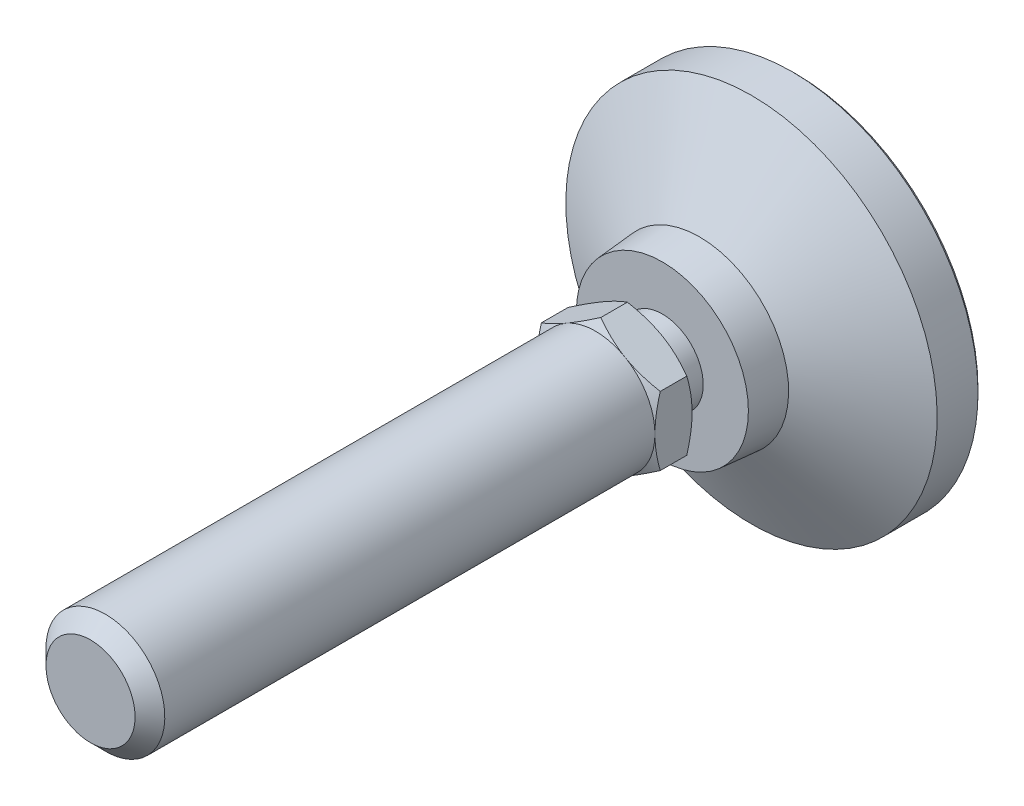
ISO-10303-21;
HEADER;
FILE_DESCRIPTION(('STEP AP214'),'2;1');
FILE_NAME('part.step','',(''),(''),'','','');
FILE_SCHEMA(('AUTOMOTIVE_DESIGN { 1 0 10303 214 1 1 1 1 }'));
ENDSEC;
DATA;
#1=APPLICATION_CONTEXT('core data for automotive mechanical design processes');
#2=APPLICATION_PROTOCOL_DEFINITION('international standard','automotive_design',2000,#1);
#3=PRODUCT_CONTEXT('',#1,'mechanical');
#4=PRODUCT('Part','Part','',(#3));
#5=PRODUCT_RELATED_PRODUCT_CATEGORY('part','',(#4));
#6=PRODUCT_DEFINITION_FORMATION('','',#4);
#7=PRODUCT_DEFINITION_CONTEXT('part definition',#1,'design');
#8=PRODUCT_DEFINITION('design','',#6,#7);
#9=PRODUCT_DEFINITION_SHAPE('','',#8);
#10=(LENGTH_UNIT() NAMED_UNIT(*) SI_UNIT(.MILLI.,.METRE.));
#11=(NAMED_UNIT(*) PLANE_ANGLE_UNIT() SI_UNIT($,.RADIAN.));
#12=(NAMED_UNIT(*) SI_UNIT($,.STERADIAN.) SOLID_ANGLE_UNIT());
#13=UNCERTAINTY_MEASURE_WITH_UNIT(LENGTH_MEASURE(1.E-05),#10,'distance_accuracy_value','');
#14=(GEOMETRIC_REPRESENTATION_CONTEXT(3) GLOBAL_UNCERTAINTY_ASSIGNED_CONTEXT((#13)) GLOBAL_UNIT_ASSIGNED_CONTEXT((#10,
#11,#12)) REPRESENTATION_CONTEXT('',''));
#15=CARTESIAN_POINT('',(0.,0.,0.));
#16=DIRECTION('',(0.,0.,1.));
#17=DIRECTION('',(1.,0.,0.));
#18=AXIS2_PLACEMENT_3D('',#15,#16,#17);
#19=CARTESIAN_POINT('',(0.,-5.50000000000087,21.9999999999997));
#20=DIRECTION('',(0.,0.,-1.));
#21=DIRECTION('',(0.,1.,0.));
#22=AXIS2_PLACEMENT_3D('',#19,#20,#21);
#23=PLANE('',#22);
#24=CARTESIAN_POINT('',(0.,0.,21.9999999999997));
#25=DIRECTION('',(0.,0.,-1.));
#26=DIRECTION('',(0.,1.,0.));
#27=AXIS2_PLACEMENT_3D('',#24,#25,#26);
#28=CIRCLE('',#27,8.00000000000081);
#29=CARTESIAN_POINT('',(-4.00000000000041,6.92820323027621,21.9999999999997));
#30=VERTEX_POINT('',#29);
#31=CARTESIAN_POINT('',(-8.00000000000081,0.,21.9999999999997));
#32=VERTEX_POINT('',#31);
#33=EDGE_CURVE('E9',#30,#32,#28,.F.);
#34=ORIENTED_EDGE('',*,*,#33,.F.);
#35=CARTESIAN_POINT('',(4.,6.92820323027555,21.9999999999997));
#36=VERTEX_POINT('',#35);
#37=EDGE_CURVE('E18',#36,#30,#28,.F.);
#38=ORIENTED_EDGE('',*,*,#37,.F.);
#39=CARTESIAN_POINT('',(8.00000000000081,0.,21.9999999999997));
#40=VERTEX_POINT('',#39);
#41=EDGE_CURVE('E125',#40,#36,#28,.F.);
#42=ORIENTED_EDGE('',*,*,#41,.F.);
#43=CARTESIAN_POINT('',(0.,0.,21.9999999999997));
#44=DIRECTION('',(0.,0.,1.));
#45=DIRECTION('',(0.,-1.,0.));
#46=AXIS2_PLACEMENT_3D('',#43,#44,#45);
#47=CIRCLE('',#46,8.00000000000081);
#48=CARTESIAN_POINT('',(4.00000000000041,-6.92820323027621,21.9999999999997));
#49=VERTEX_POINT('',#48);
#50=EDGE_CURVE('E599',#49,#40,#47,.T.);
#51=ORIENTED_EDGE('',*,*,#50,.F.);
#52=CARTESIAN_POINT('',(-4.00000000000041,-6.92820323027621,21.9999999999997));
#53=VERTEX_POINT('',#52);
#54=EDGE_CURVE('E601',#53,#49,#28,.F.);
#55=ORIENTED_EDGE('',*,*,#54,.F.);
#56=EDGE_CURVE('E23',#32,#53,#28,.F.);
#57=ORIENTED_EDGE('',*,*,#56,.F.);
#58=EDGE_LOOP('',(#34,#38,#42,#51,#55,#57));
#59=FACE_BOUND('',#58,.T.);
#60=CARTESIAN_POINT('',(0.,0.,21.9999999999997));
#61=DIRECTION('',(0.,0.,-1.));
#62=DIRECTION('',(0.,1.,0.));
#63=AXIS2_PLACEMENT_3D('',#60,#61,#62);
#64=CIRCLE('',#63,5.50000000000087);
#65=CARTESIAN_POINT('',(0.,5.50000000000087,21.9999999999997));
#66=VERTEX_POINT('',#65);
#67=EDGE_CURVE('E226',#66,#66,#64,.T.);
#68=ORIENTED_EDGE('',*,*,#67,.F.);
#69=EDGE_LOOP('',(#68));
#70=FACE_BOUND('',#69,.T.);
#71=ADVANCED_FACE('F14',(#59,#70),#23,.T.);
#72=CARTESIAN_POINT('',(0.,0.,-1.));
#73=DIRECTION('',(0.,0.,-1.));
#74=DIRECTION('',(0.,1.,0.));
#75=AXIS2_PLACEMENT_3D('',#72,#73,#74);
#76=CYLINDRICAL_SURFACE('',#75,5.50000000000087);
#77=CARTESIAN_POINT('',(0.,0.,18.));
#78=DIRECTION('',(0.,0.,-1.));
#79=DIRECTION('',(0.,1.,0.));
#80=AXIS2_PLACEMENT_3D('',#77,#78,#79);
#81=CIRCLE('',#80,5.50000000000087);
#82=CARTESIAN_POINT('',(0.,5.50000000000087,18.));
#83=VERTEX_POINT('',#82);
#84=EDGE_CURVE('E229',#83,#83,#81,.T.);
#85=ORIENTED_EDGE('',*,*,#84,.F.);
#86=EDGE_LOOP('',(#85));
#87=FACE_BOUND('',#86,.T.);
#88=ORIENTED_EDGE('',*,*,#67,.T.);
#89=EDGE_LOOP('',(#88));
#90=FACE_BOUND('',#89,.T.);
#91=ADVANCED_FACE('F289',(#87,#90),#76,.T.);
#92=CARTESIAN_POINT('',(0.,-5.50000000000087,18.));
#93=DIRECTION('',(0.,0.,1.));
#94=DIRECTION('',(0.,-1.,0.));
#95=AXIS2_PLACEMENT_3D('',#92,#93,#94);
#96=PLANE('',#95);
#97=ORIENTED_EDGE('',*,*,#84,.T.);
#98=EDGE_LOOP('',(#97));
#99=FACE_BOUND('',#98,.T.);
#100=CARTESIAN_POINT('',(0.,0.,18.));
#101=DIRECTION('',(0.,0.,1.));
#102=DIRECTION('',(0.,-1.,0.));
#103=AXIS2_PLACEMENT_3D('',#100,#101,#102);
#104=CIRCLE('',#103,11.5833333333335);
#105=CARTESIAN_POINT('',(0.,-11.5833333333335,18.));
#106=VERTEX_POINT('',#105);
#107=EDGE_CURVE('E232',#106,#106,#104,.T.);
#108=ORIENTED_EDGE('',*,*,#107,.T.);
#109=EDGE_LOOP('',(#108));
#110=FACE_BOUND('',#109,.T.);
#111=ADVANCED_FACE('F281',(#99,#110),#96,.T.);
#112=CARTESIAN_POINT('',(0.,0.,0.));
#113=DIRECTION('',(0.,0.,-1.));
#114=DIRECTION('',(0.,1.,0.));
#115=AXIS2_PLACEMENT_3D('',#112,#113,#114);
#116=PLANE('',#115);
#117=CARTESIAN_POINT('',(0.,0.,0.));
#118=DIRECTION('',(0.,0.,-1.));
#119=DIRECTION('',(0.,1.,0.));
#120=AXIS2_PLACEMENT_3D('',#117,#118,#119);
#121=CIRCLE('',#120,24.5);
#122=CARTESIAN_POINT('',(0.,24.5,0.));
#123=VERTEX_POINT('',#122);
#124=EDGE_CURVE('E267',#123,#123,#121,.T.);
#125=ORIENTED_EDGE('',*,*,#124,.T.);
#126=EDGE_LOOP('',(#125));
#127=FACE_BOUND('',#126,.T.);
#128=ADVANCED_FACE('F199',(#127),#116,.T.);
#129=CARTESIAN_POINT('',(0.,0.,-1.));
#130=DIRECTION('',(0.,0.,-1.));
#131=DIRECTION('',(0.,1.,0.));
#132=AXIS2_PLACEMENT_3D('',#129,#130,#131);
#133=CYLINDRICAL_SURFACE('',#132,25.);
#134=CARTESIAN_POINT('',(0.,0.,0.500000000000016));
#135=DIRECTION('',(0.,0.,-1.));
#136=DIRECTION('',(0.,1.,0.));
#137=AXIS2_PLACEMENT_3D('',#134,#135,#136);
#138=CIRCLE('',#137,25.);
#139=CARTESIAN_POINT('',(0.,25.,0.500000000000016));
#140=VERTEX_POINT('',#139);
#141=EDGE_CURVE('E126',#140,#140,#138,.F.);
#142=ORIENTED_EDGE('',*,*,#141,.T.);
#143=EDGE_LOOP('',(#142));
#144=FACE_BOUND('',#143,.T.);
#145=CARTESIAN_POINT('',(0.,0.,5.9999999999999));
#146=DIRECTION('',(0.,0.,-1.));
#147=DIRECTION('',(0.,1.,0.));
#148=AXIS2_PLACEMENT_3D('',#145,#146,#147);
#149=CIRCLE('',#148,25.);
#150=CARTESIAN_POINT('',(0.,25.,5.9999999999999));
#151=VERTEX_POINT('',#150);
#152=EDGE_CURVE('E235',#151,#151,#149,.T.);
#153=ORIENTED_EDGE('',*,*,#152,.T.);
#154=EDGE_LOOP('',(#153));
#155=FACE_BOUND('',#154,.T.);
#156=ADVANCED_FACE('F272',(#144,#155),#133,.T.);
#157=CARTESIAN_POINT('',(0.,0.,13.));
#158=DIRECTION('',(0.,0.,-1.));
#159=DIRECTION('',(0.,1.,0.));
#160=AXIS2_PLACEMENT_3D('',#157,#158,#159);
#161=CONICAL_SURFACE('',#160,12.0000000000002,1.07685495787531);
#162=ORIENTED_EDGE('',*,*,#152,.F.);
#163=EDGE_LOOP('',(#162));
#164=FACE_BOUND('',#163,.T.);
#165=CARTESIAN_POINT('',(0.,0.,13.));
#166=DIRECTION('',(0.,0.,-1.));
#167=DIRECTION('',(0.,1.,0.));
#168=AXIS2_PLACEMENT_3D('',#165,#166,#167);
#169=CIRCLE('',#168,12.0000000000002);
#170=CARTESIAN_POINT('',(0.,12.0000000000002,13.));
#171=VERTEX_POINT('',#170);
#172=EDGE_CURVE('E251',#171,#171,#169,.T.);
#173=ORIENTED_EDGE('',*,*,#172,.T.);
#174=EDGE_LOOP('',(#173));
#175=FACE_BOUND('',#174,.T.);
#176=ADVANCED_FACE('F288',(#164,#175),#161,.T.);
#177=CARTESIAN_POINT('',(0.,0.,19.));
#178=DIRECTION('',(0.,0.,-1.));
#179=DIRECTION('',(0.,1.,0.));
#180=AXIS2_PLACEMENT_3D('',#177,#178,#179);
#181=CONICAL_SURFACE('',#180,11.5000000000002,0.0831412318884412);
#182=ORIENTED_EDGE('',*,*,#172,.F.);
#183=EDGE_LOOP('',(#182));
#184=FACE_BOUND('',#183,.T.);
#185=ORIENTED_EDGE('',*,*,#107,.F.);
#186=EDGE_LOOP('',(#185));
#187=FACE_BOUND('',#186,.T.);
#188=ADVANCED_FACE('F277',(#184,#187),#181,.T.);
#189=CARTESIAN_POINT('',(0.,0.,0.));
#190=DIRECTION('',(0.,0.,1.));
#191=DIRECTION('',(0.,-1.,0.));
#192=AXIS2_PLACEMENT_3D('',#189,#190,#191);
#193=CONICAL_SURFACE('',#192,24.5,0.785398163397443);
#194=ORIENTED_EDGE('',*,*,#141,.F.);
#195=EDGE_LOOP('',(#194));
#196=FACE_BOUND('',#195,.T.);
#197=ORIENTED_EDGE('',*,*,#124,.F.);
#198=EDGE_LOOP('',(#197));
#199=FACE_BOUND('',#198,.T.);
#200=ADVANCED_FACE('F16',(#196,#199),#193,.T.);
#201=CARTESIAN_POINT('',(0.,0.,21.9999999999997));
#202=DIRECTION('',(0.,0.,1.));
#203=DIRECTION('',(0.,-1.,0.));
#204=AXIS2_PLACEMENT_3D('',#201,#202,#203);
#205=CONICAL_SURFACE('',#204,8.00000000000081,1.0471975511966);
#206=CARTESIAN_POINT('',(-8.0002,4.61868668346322,22.7145978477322));
#207=CARTESIAN_POINT('',(-7.8243512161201,4.72021302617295,22.6559907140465));
#208=CARTESIAN_POINT('',(-7.64784680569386,4.8221178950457,22.6000434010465));
#209=CARTESIAN_POINT('',(-7.29340453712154,5.02675523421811,22.4942010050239));
#210=CARTESIAN_POINT('',(-7.11546609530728,5.12948804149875,22.4443085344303));
#211=CARTESIAN_POINT('',(-6.57880176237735,5.43933133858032,22.3046927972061));
#212=CARTESIAN_POINT('',(-6.21795741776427,5.64766491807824,22.2252811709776));
#213=CARTESIAN_POINT('',(-5.67796082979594,5.95943209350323,22.1321616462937));
#214=CARTESIAN_POINT('',(-5.50042181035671,6.06193429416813,22.1056345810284));
#215=CARTESIAN_POINT('',(-5.14454088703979,6.26740224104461,22.0611531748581));
#216=CARTESIAN_POINT('',(-4.96619905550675,6.37036794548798,22.0431980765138));
#217=CARTESIAN_POINT('',(-4.6092083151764,6.57647664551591,22.0163156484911));
#218=CARTESIAN_POINT('',(-4.43055998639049,6.67961930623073,22.0073780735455));
#219=CARTESIAN_POINT('',(-4.07309829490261,6.88599991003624,21.9987223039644));
#220=CARTESIAN_POINT('',(-3.89428493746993,6.9892378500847,21.9990038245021));
#221=CARTESIAN_POINT('',(-3.55998663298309,7.18224506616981,22.008145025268));
#222=CARTESIAN_POINT('',(-3.40447809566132,7.27202796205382,22.0158896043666));
#223=CARTESIAN_POINT('',(-3.09382523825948,7.45138347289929,22.0382011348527));
#224=CARTESIAN_POINT('',(-2.93868094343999,7.54095607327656,22.0527685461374));
#225=CARTESIAN_POINT('',(-2.47384868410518,7.80932710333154,22.1063606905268));
#226=CARTESIAN_POINT('',(-2.16498351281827,7.98765049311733,22.1552686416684));
#227=CARTESIAN_POINT('',(-1.54397677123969,8.3461889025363,22.2775394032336));
#228=CARTESIAN_POINT('',(-1.23191445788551,8.52635816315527,22.3514205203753));
#229=CARTESIAN_POINT('',(-0.61244351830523,8.8840098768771,22.5191001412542));
#230=CARTESIAN_POINT('',(-0.305026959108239,9.06149691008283,22.6128592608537));
#231=CARTESIAN_POINT('',(0.000200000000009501,9.23771977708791,22.7145978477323));
#232=B_SPLINE_CURVE_WITH_KNOTS('',3,(#206,#207,#208,#209,#210,#211,#212,#213,#214,#215,#216,
#217,#218,#219,#220,#221,#222,#223,#224,#225,#226,#227,#228,#229,#230,#231),.UNSPECIFIED.,.F.,
.F.,(4,2,2,2,2,2,2,2,2,2,2,2,4),(0.,0.633973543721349,1.26821965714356,2.53934712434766,
3.15934343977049,3.77928496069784,4.39852133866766,5.01773858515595,5.55680239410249,
6.09590254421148,7.17487077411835,8.27776850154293,9.37850115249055),.UNSPECIFIED.);
#233=CARTESIAN_POINT('',(0.,9.23760430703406,22.7145311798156));
#234=VERTEX_POINT('',#233);
#235=EDGE_CURVE('E115',#30,#234,#232,.T.);
#236=ORIENTED_EDGE('',*,*,#235,.T.);
#237=CARTESIAN_POINT('',(-0.000199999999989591,9.2377197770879,22.7145978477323));
#238=CARTESIAN_POINT('',(0.175648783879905,9.13619343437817,22.6559907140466));
#239=CARTESIAN_POINT('',(0.352153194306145,9.03428856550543,22.6000434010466));
#240=CARTESIAN_POINT('',(0.706595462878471,8.82965122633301,22.4942010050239));
#241=CARTESIAN_POINT('',(0.884533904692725,8.72691841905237,22.4443085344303));
#242=CARTESIAN_POINT('',(1.42119823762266,8.4170751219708,22.3046927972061));
#243=CARTESIAN_POINT('',(1.78204258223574,8.20874154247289,22.2252811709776));
#244=CARTESIAN_POINT('',(2.32203917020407,7.89697436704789,22.1321616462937));
#245=CARTESIAN_POINT('',(2.49957818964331,7.79447216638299,22.1056345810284));
#246=CARTESIAN_POINT('',(2.85545911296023,7.58900421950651,22.0611531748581));
#247=CARTESIAN_POINT('',(3.03380094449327,7.48603851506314,22.0431980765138));
#248=CARTESIAN_POINT('',(3.39079168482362,7.2799298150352,22.0163156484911));
#249=CARTESIAN_POINT('',(3.56944001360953,7.17678715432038,22.0073780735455));
#250=CARTESIAN_POINT('',(3.92690170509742,6.97040655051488,21.9987223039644));
#251=CARTESIAN_POINT('',(4.1057150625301,6.86716861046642,21.9990038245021));
#252=CARTESIAN_POINT('',(4.44001336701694,6.67416139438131,22.008145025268));
#253=CARTESIAN_POINT('',(4.5955219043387,6.5843784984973,22.0158896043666));
#254=CARTESIAN_POINT('',(4.90617476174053,6.40502298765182,22.0382011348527));
#255=CARTESIAN_POINT('',(5.06131905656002,6.31545038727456,22.0527685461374));
#256=CARTESIAN_POINT('',(5.52615131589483,6.04707935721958,22.1063606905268));
#257=CARTESIAN_POINT('',(5.83501648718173,5.86875596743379,22.1552686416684));
#258=CARTESIAN_POINT('',(6.45602322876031,5.51021755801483,22.2775394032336));
#259=CARTESIAN_POINT('',(6.76808554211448,5.33004829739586,22.3514205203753));
#260=CARTESIAN_POINT('',(7.38755648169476,4.97239658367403,22.5191001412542));
#261=CARTESIAN_POINT('',(7.69497304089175,4.79490955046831,22.6128592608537));
#262=CARTESIAN_POINT('',(8.0002,4.61868668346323,22.7145978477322));
#263=B_SPLINE_CURVE_WITH_KNOTS('',3,(#237,#238,#239,#240,#241,#242,#243,#244,#245,#246,#247,
#248,#249,#250,#251,#252,#253,#254,#255,#256,#257,#258,#259,#260,#261,#262),.UNSPECIFIED.,.F.,
.F.,(4,2,2,2,2,2,2,2,2,2,2,2,4),(0.,0.633973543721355,1.26821965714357,2.53934712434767,
3.15934343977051,3.77928496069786,4.39852133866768,5.01773858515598,5.55680239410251,
6.09590254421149,7.17487077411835,8.27776850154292,9.37850115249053),.UNSPECIFIED.);
#264=EDGE_CURVE('E121',#234,#36,#263,.T.);
#265=ORIENTED_EDGE('',*,*,#264,.T.);
#266=ORIENTED_EDGE('',*,*,#37,.T.);
#267=EDGE_LOOP('',(#236,#265,#266));
#268=FACE_BOUND('',#267,.T.);
#269=ADVANCED_FACE('F119',(#268),#205,.T.);
#270=CARTESIAN_POINT('',(8.,12.3485370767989,25.876027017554));
#271=CARTESIAN_POINT('',(8.,11.9996128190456,25.7070020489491));
#272=CARTESIAN_POINT('',(8.,11.6498813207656,25.5396146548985));
#273=CARTESIAN_POINT('',(8.,10.9483743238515,25.2090371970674));
#274=CARTESIAN_POINT('',(8.,10.5965985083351,25.0458478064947));
#275=CARTESIAN_POINT('',(8.,9.88873279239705,24.7237550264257));
#276=CARTESIAN_POINT('',(8.,9.53262979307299,24.5648803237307));
#277=CARTESIAN_POINT('',(8.,8.81757115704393,24.2537106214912));
#278=CARTESIAN_POINT('',(8.,8.45861565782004,24.1014153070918));
#279=CARTESIAN_POINT('',(8.,7.7259103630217,23.8004732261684));
#280=CARTESIAN_POINT('',(8.,7.35205069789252,23.6520924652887));
#281=CARTESIAN_POINT('',(8.,6.59993691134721,23.3667023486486));
#282=CARTESIAN_POINT('',(8.,6.22168229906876,23.229694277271));
#283=CARTESIAN_POINT('',(8.,5.46089929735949,22.9706894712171));
#284=CARTESIAN_POINT('',(8.,5.07838154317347,22.8486618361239));
#285=CARTESIAN_POINT('',(8.,4.30787342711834,22.6235701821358));
#286=CARTESIAN_POINT('',(8.,3.91988484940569,22.5205001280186));
#287=CARTESIAN_POINT('',(8.,3.14029784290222,22.3388616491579));
#288=CARTESIAN_POINT('',(8.,2.74873078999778,22.2601622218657));
#289=CARTESIAN_POINT('',(8.,2.157861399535,22.1638258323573));
#290=CARTESIAN_POINT('',(8.,1.96030347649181,22.1353311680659));
#291=CARTESIAN_POINT('',(8.,1.56422556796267,22.0861396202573));
#292=CARTESIAN_POINT('',(8.,1.36570567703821,22.0654419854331));
#293=CARTESIAN_POINT('',(8.,0.970537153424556,22.0325133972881));
#294=CARTESIAN_POINT('',(8.,0.773897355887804,22.0201768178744));
#295=CARTESIAN_POINT('',(8.,0.380272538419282,22.0038261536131));
#296=CARTESIAN_POINT('',(8.,0.183287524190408,21.9998119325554));
#297=CARTESIAN_POINT('',(8.,-0.210676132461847,22.0002016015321));
#298=CARTESIAN_POINT('',(8.,-0.407654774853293,22.0046055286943));
#299=CARTESIAN_POINT('',(8.,-0.80125313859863,22.0217248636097));
#300=CARTESIAN_POINT('',(8.,-0.997872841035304,22.0344406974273));
#301=CARTESIAN_POINT('',(8.,-1.47219850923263,22.0748753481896));
#302=CARTESIAN_POINT('',(8.,-1.74956690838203,22.1066371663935));
#303=CARTESIAN_POINT('',(8.,-2.30219351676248,22.184955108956));
#304=CARTESIAN_POINT('',(8.,-2.57745142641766,22.2315132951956));
#305=CARTESIAN_POINT('',(8.,-3.39977454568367,22.3909091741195));
#306=CARTESIAN_POINT('',(8.,-3.9430706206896,22.523437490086));
#307=CARTESIAN_POINT('',(8.,-4.75534297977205,22.7525978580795));
#308=CARTESIAN_POINT('',(8.,-5.02854925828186,22.8350932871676));
#309=CARTESIAN_POINT('',(8.,-5.57230728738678,23.008490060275));
#310=CARTESIAN_POINT('',(8.,-5.84285902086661,23.0993914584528));
#311=CARTESIAN_POINT('',(8.,-6.38139598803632,23.2881552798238));
#312=CARTESIAN_POINT('',(8.,-6.64938207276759,23.386015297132));
#313=CARTESIAN_POINT('',(8.,-7.18314516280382,23.5875611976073));
#314=CARTESIAN_POINT('',(8.,-7.44892219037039,23.6912470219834));
#315=CARTESIAN_POINT('',(8.,-8.06083609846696,23.9364645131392));
#316=CARTESIAN_POINT('',(8.,-8.40627199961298,24.0797418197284));
#317=CARTESIAN_POINT('',(8.,-9.09432556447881,24.3729291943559));
#318=CARTESIAN_POINT('',(8.,-9.43694307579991,24.5228396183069));
#319=CARTESIAN_POINT('',(8.,-10.1198578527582,24.8280042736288));
#320=CARTESIAN_POINT('',(8.,-10.4601546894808,24.9832594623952));
#321=CARTESIAN_POINT('',(8.,-11.1387525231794,25.2980794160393));
#322=CARTESIAN_POINT('',(8.,-11.4770534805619,25.4576442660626));
#323=CARTESIAN_POINT('',(8.,-12.1523013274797,25.7804548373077));
#324=CARTESIAN_POINT('',(8.,-12.4892465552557,25.943704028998));
#325=CARTESIAN_POINT('',(8.,-13.1617078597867,26.2731224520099));
#326=CARTESIAN_POINT('',(8.,-13.4972239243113,26.4392917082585));
#327=CARTESIAN_POINT('',(8.,-14.5018793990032,26.9413849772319));
#328=CARTESIAN_POINT('',(8.,-15.1692072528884,27.2809335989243));
#329=CARTESIAN_POINT('',(8.,-16.4469874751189,27.9394117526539));
#330=CARTESIAN_POINT('',(8.,-17.0577129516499,28.2578136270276));
#331=CARTESIAN_POINT('',(8.,-18.27687034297,28.8990216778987));
#332=CARTESIAN_POINT('',(8.,-18.8853021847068,29.22182799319));
#333=CARTESIAN_POINT('',(8.,-20.0989540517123,29.8700575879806));
#334=CARTESIAN_POINT('',(8.,-20.7041782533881,30.195473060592));
#335=CARTESIAN_POINT('',(8.,-21.9131505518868,30.848961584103));
#336=CARTESIAN_POINT('',(8.,-22.5168987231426,31.1770344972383));
#337=CARTESIAN_POINT('',(8.,-23.1200991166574,31.5061047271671));
#338=B_SPLINE_CURVE_WITH_KNOTS('',3,(#270,#271,#272,#273,#274,#275,#276,#277,#278,#279,#280,
#281,#282,#283,#284,#285,#286,#287,#288,#289,#290,#291,#292,#293,#294,#295,#296,#297,#298,#299,
#300,#301,#302,#303,#304,#305,#306,#307,#308,#309,#310,#311,#312,#313,#314,#315,#316,#317,#318,
#319,#320,#321,#322,#323,#324,#325,#326,#327,#328,#329,#330,#331,#332,#333,#334,#335,#336,#337),
.UNSPECIFIED.,.F.,.F.,(4,2,2,2,2,2,2,2,2,2,2,2,2,2,2,2,2,2,2,2,2,2,2,2,2,2,2,2,2,2,2,2,2,4),(0.,
1.16313881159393,2.32646300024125,3.49621936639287,4.66591969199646,5.87246216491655,
7.07914071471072,8.28328684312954,9.48704896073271,10.6842232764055,11.2829004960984,
11.881520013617,12.4724286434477,13.0633276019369,13.6542291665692,14.245161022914,
15.0822298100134,15.9194152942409,17.5947419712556,18.4508411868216,19.3069459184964,
20.1627560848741,21.0185576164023,22.1403791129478,23.2622608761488,24.3843446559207,
25.5064506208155,26.6296617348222,27.7528824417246,29.9990536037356,32.0652599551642,
34.131531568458,36.193010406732,38.2543830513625),.UNSPECIFIED.);
#339=CARTESIAN_POINT('',(8.,4.61880215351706,22.7145311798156));
#340=VERTEX_POINT('',#339);
#341=EDGE_CURVE('E134',#340,#40,#338,.T.);
#342=ORIENTED_EDGE('',*,*,#341,.T.);
#343=ORIENTED_EDGE('',*,*,#41,.T.);
#344=EDGE_CURVE('E171',#36,#340,#263,.T.);
#345=ORIENTED_EDGE('',*,*,#344,.T.);
#346=EDGE_LOOP('',(#342,#343,#345));
#347=FACE_BOUND('',#346,.T.);
#348=ADVANCED_FACE('F159',(#347),#205,.T.);
#349=CARTESIAN_POINT('',(8.0002,-4.61868668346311,22.7145978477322));
#350=CARTESIAN_POINT('',(7.82435121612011,-4.72021302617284,22.6559907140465));
#351=CARTESIAN_POINT('',(7.64784680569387,-4.82211789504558,22.6000434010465));
#352=CARTESIAN_POINT('',(7.29340453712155,-5.02675523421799,22.4942010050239));
#353=CARTESIAN_POINT('',(7.11546609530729,-5.12948804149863,22.4443085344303));
#354=CARTESIAN_POINT('',(6.57880176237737,-5.4393313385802,22.3046927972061));
#355=CARTESIAN_POINT('',(6.21795741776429,-5.64766491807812,22.2252811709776));
#356=CARTESIAN_POINT('',(5.67796082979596,-5.95943209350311,22.1321616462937));
#357=CARTESIAN_POINT('',(5.50042181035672,-6.06193429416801,22.1056345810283));
#358=CARTESIAN_POINT('',(5.14454088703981,-6.26740224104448,22.0611531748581));
#359=CARTESIAN_POINT('',(4.96619905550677,-6.37036794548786,22.0431980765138));
#360=CARTESIAN_POINT('',(4.60920831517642,-6.57647664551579,22.0163156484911));
#361=CARTESIAN_POINT('',(4.43055998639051,-6.67961930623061,22.0073780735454));
#362=CARTESIAN_POINT('',(4.07309829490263,-6.88599991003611,21.9987223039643));
#363=CARTESIAN_POINT('',(3.89428493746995,-6.98923785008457,21.999003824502));
#364=CARTESIAN_POINT('',(3.55998663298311,-7.18224506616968,22.008145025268));
#365=CARTESIAN_POINT('',(3.40447809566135,-7.27202796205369,22.0158896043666));
#366=CARTESIAN_POINT('',(3.09382523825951,-7.45138347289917,22.0382011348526));
#367=CARTESIAN_POINT('',(2.93868094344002,-7.54095607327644,22.0527685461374));
#368=CARTESIAN_POINT('',(2.4738486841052,-7.80932710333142,22.1063606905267));
#369=CARTESIAN_POINT('',(2.16498351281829,-7.98765049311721,22.1552686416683));
#370=CARTESIAN_POINT('',(1.54397677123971,-8.34618890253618,22.2775394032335));
#371=CARTESIAN_POINT('',(1.23191445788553,-8.52635816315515,22.3514205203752));
#372=CARTESIAN_POINT('',(0.61244351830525,-8.88400987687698,22.5191001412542));
#373=CARTESIAN_POINT('',(0.305026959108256,-9.06149691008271,22.6128592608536));
#374=CARTESIAN_POINT('',(-0.000199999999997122,-9.23771977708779,22.7145978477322));
#375=B_SPLINE_CURVE_WITH_KNOTS('',3,(#349,#350,#351,#352,#353,#354,#355,#356,#357,#358,#359,
#360,#361,#362,#363,#364,#365,#366,#367,#368,#369,#370,#371,#372,#373,#374),.UNSPECIFIED.,.F.,
.F.,(4,2,2,2,2,2,2,2,2,2,2,2,4),(0.,0.63397354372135,1.26821965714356,2.53934712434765,
3.15934343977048,3.77928496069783,4.39852133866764,5.01773858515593,5.55680239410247,
6.09590254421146,7.17487077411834,8.27776850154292,9.37850115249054),.UNSPECIFIED.);
#376=CARTESIAN_POINT('',(8.,-4.61880215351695,22.7145311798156));
#377=VERTEX_POINT('',#376);
#378=EDGE_CURVE('E149',#377,#49,#375,.T.);
#379=ORIENTED_EDGE('',*,*,#378,.T.);
#380=ORIENTED_EDGE('',*,*,#50,.T.);
#381=EDGE_CURVE('E114',#40,#377,#338,.T.);
#382=ORIENTED_EDGE('',*,*,#381,.T.);
#383=EDGE_LOOP('',(#379,#380,#382));
#384=FACE_BOUND('',#383,.T.);
#385=ADVANCED_FACE('F163',(#384),#205,.T.);
#386=CARTESIAN_POINT('',(0.000200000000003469,-9.23771977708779,22.7145978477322));
#387=CARTESIAN_POINT('',(-0.175648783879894,-9.13619343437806,22.6559907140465));
#388=CARTESIAN_POINT('',(-0.352153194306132,-9.03428856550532,22.6000434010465));
#389=CARTESIAN_POINT('',(-0.706595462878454,-8.8296512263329,22.4942010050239));
#390=CARTESIAN_POINT('',(-0.884533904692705,-8.72691841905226,22.4443085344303));
#391=CARTESIAN_POINT('',(-1.42119823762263,-8.4170751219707,22.3046927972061));
#392=CARTESIAN_POINT('',(-1.78204258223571,-8.20874154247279,22.2252811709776));
#393=CARTESIAN_POINT('',(-2.32203917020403,-7.8969743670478,22.1321616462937));
#394=CARTESIAN_POINT('',(-2.49957818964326,-7.79447216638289,22.1056345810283));
#395=CARTESIAN_POINT('',(-2.85545911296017,-7.58900421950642,22.0611531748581));
#396=CARTESIAN_POINT('',(-3.03380094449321,-7.48603851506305,22.0431980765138));
#397=CARTESIAN_POINT('',(-3.39079168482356,-7.27992981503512,22.0163156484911));
#398=CARTESIAN_POINT('',(-3.56944001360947,-7.1767871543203,22.0073780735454));
#399=CARTESIAN_POINT('',(-3.92690170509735,-6.97040655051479,21.9987223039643));
#400=CARTESIAN_POINT('',(-4.10571506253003,-6.86716861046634,21.999003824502));
#401=CARTESIAN_POINT('',(-4.44001336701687,-6.67416139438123,22.008145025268));
#402=CARTESIAN_POINT('',(-4.59552190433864,-6.58437849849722,22.0158896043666));
#403=CARTESIAN_POINT('',(-4.90617476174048,-6.40502298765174,22.0382011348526));
#404=CARTESIAN_POINT('',(-5.06131905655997,-6.31545038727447,22.0527685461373));
#405=CARTESIAN_POINT('',(-5.52615131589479,-6.04707935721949,22.1063606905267));
#406=CARTESIAN_POINT('',(-5.8350164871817,-5.86875596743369,22.1552686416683));
#407=CARTESIAN_POINT('',(-6.45602322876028,-5.51021755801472,22.2775394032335));
#408=CARTESIAN_POINT('',(-6.76808554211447,-5.33004829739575,22.3514205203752));
#409=CARTESIAN_POINT('',(-7.38755648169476,-4.97239658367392,22.5191001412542));
#410=CARTESIAN_POINT('',(-7.69497304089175,-4.79490955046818,22.6128592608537));
#411=CARTESIAN_POINT('',(-8.0002,-4.6186866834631,22.7145978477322));
#412=B_SPLINE_CURVE_WITH_KNOTS('',3,(#386,#387,#388,#389,#390,#391,#392,#393,#394,#395,#396,
#397,#398,#399,#400,#401,#402,#403,#404,#405,#406,#407,#408,#409,#410,#411),.UNSPECIFIED.,.F.,
.F.,(4,2,2,2,2,2,2,2,2,2,2,2,4),(0.,0.633973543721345,1.26821965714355,2.53934712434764,
3.15934343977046,3.7792849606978,4.39852133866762,5.01773858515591,5.55680239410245,
6.09590254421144,7.17487077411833,8.27776850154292,9.37850115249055),.UNSPECIFIED.);
#413=CARTESIAN_POINT('',(0.,-9.23760430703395,22.7145311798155));
#414=VERTEX_POINT('',#413);
#415=EDGE_CURVE('E37',#414,#53,#412,.T.);
#416=ORIENTED_EDGE('',*,*,#415,.T.);
#417=ORIENTED_EDGE('',*,*,#54,.T.);
#418=EDGE_CURVE('E542',#49,#414,#375,.T.);
#419=ORIENTED_EDGE('',*,*,#418,.T.);
#420=EDGE_LOOP('',(#416,#417,#419));
#421=FACE_BOUND('',#420,.T.);
#422=ADVANCED_FACE('F165',(#421),#205,.T.);
#423=CARTESIAN_POINT('',(-8.,-4.61880215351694,22.7145311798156));
#424=VERTEX_POINT('',#423);
#425=EDGE_CURVE('E186',#53,#424,#412,.T.);
#426=ORIENTED_EDGE('',*,*,#425,.T.);
#427=CARTESIAN_POINT('',(-8.,12.3485370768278,25.876027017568));
#428=CARTESIAN_POINT('',(-8.,11.9996128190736,25.7070020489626));
#429=CARTESIAN_POINT('',(-8.00000000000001,11.6498813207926,25.5396146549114));
#430=CARTESIAN_POINT('',(-8.00000000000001,10.9483743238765,25.209037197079));
#431=CARTESIAN_POINT('',(-8.00000000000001,10.5965985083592,25.0458478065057));
#432=CARTESIAN_POINT('',(-8.00000000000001,9.88873279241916,24.7237550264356));
#433=CARTESIAN_POINT('',(-8.00000000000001,9.53262979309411,24.5648803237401));
#434=CARTESIAN_POINT('',(-8.00000000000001,8.81757115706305,24.2537106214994));
#435=CARTESIAN_POINT('',(-8.00000000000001,8.45861565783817,24.1014153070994));
#436=CARTESIAN_POINT('',(-8.00000000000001,7.72591036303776,23.8004732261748));
#437=CARTESIAN_POINT('',(-8.00000000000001,7.35205069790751,23.6520924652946));
#438=CARTESIAN_POINT('',(-8.00000000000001,6.59993691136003,23.3667023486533));
#439=CARTESIAN_POINT('',(-8.,6.2216822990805,23.2296942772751));
#440=CARTESIAN_POINT('',(-8.,5.46089929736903,22.9706894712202));
#441=CARTESIAN_POINT('',(-8.00000000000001,5.07838154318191,22.8486618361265));
#442=CARTESIAN_POINT('',(-8.,4.30787342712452,22.6235701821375));
#443=CARTESIAN_POINT('',(-8.,3.91988484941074,22.5205001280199));
#444=CARTESIAN_POINT('',(-8.,3.1402978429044,22.3388616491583));
#445=CARTESIAN_POINT('',(-8.,2.7487307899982,22.2601622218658));
#446=CARTESIAN_POINT('',(-8.,2.15786139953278,22.1638258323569));
#447=CARTESIAN_POINT('',(-8.,1.9603034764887,22.1353311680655));
#448=CARTESIAN_POINT('',(-8.,1.56422556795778,22.0861396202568));
#449=CARTESIAN_POINT('',(-8.,1.36570567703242,22.0654419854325));
#450=CARTESIAN_POINT('',(-8.,0.970537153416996,22.0325133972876));
#451=CARTESIAN_POINT('',(-8.,0.773897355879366,22.0201768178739));
#452=CARTESIAN_POINT('',(-8.,0.380272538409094,22.0038261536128));
#453=CARTESIAN_POINT('',(-8.,0.183287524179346,21.9998119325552));
#454=CARTESIAN_POINT('',(-8.,-0.210676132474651,22.0002016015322));
#455=CARTESIAN_POINT('',(-8.,-0.407654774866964,22.0046055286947));
#456=CARTESIAN_POINT('',(-8.,-0.801253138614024,22.0217248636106));
#457=CARTESIAN_POINT('',(-8.,-0.997872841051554,22.0344406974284));
#458=CARTESIAN_POINT('',(-8.,-1.47219850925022,22.0748753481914));
#459=CARTESIAN_POINT('',(-8.,-1.74956690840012,22.1066371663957));
#460=CARTESIAN_POINT('',(-8.,-2.30219351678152,22.184955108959));
#461=CARTESIAN_POINT('',(-8.,-2.57745142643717,22.2315132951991));
#462=CARTESIAN_POINT('',(-8.,-3.39977454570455,22.3909091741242));
#463=CARTESIAN_POINT('',(-8.,-3.94307062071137,22.5234374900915));
#464=CARTESIAN_POINT('',(-8.,-4.75534297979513,22.7525978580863));
#465=CARTESIAN_POINT('',(-8.,-5.0285492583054,22.8350932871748));
#466=CARTESIAN_POINT('',(-8.,-5.57230728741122,23.0084900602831));
#467=CARTESIAN_POINT('',(-8.,-5.84285902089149,23.0993914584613));
#468=CARTESIAN_POINT('',(-8.,-6.38139598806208,23.2881552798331));
#469=CARTESIAN_POINT('',(-8.,-6.6493820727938,23.3860152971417));
#470=CARTESIAN_POINT('',(-8.,-7.1831451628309,23.5875611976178));
#471=CARTESIAN_POINT('',(-8.,-7.44892219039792,23.6912470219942));
#472=CARTESIAN_POINT('',(-8.,-8.0608360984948,23.9364645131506));
#473=CARTESIAN_POINT('',(-8.,-8.4062719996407,24.07974181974));
#474=CARTESIAN_POINT('',(-8.,-9.0943255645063,24.3729291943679));
#475=CARTESIAN_POINT('',(-8.,-9.43694307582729,24.5228396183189));
#476=CARTESIAN_POINT('',(-8.,-10.1198578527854,24.8280042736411));
#477=CARTESIAN_POINT('',(-8.,-10.4601546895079,24.9832594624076));
#478=CARTESIAN_POINT('',(-8.,-11.1387525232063,25.2980794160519));
#479=CARTESIAN_POINT('',(-8.,-11.4770534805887,25.4576442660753));
#480=CARTESIAN_POINT('',(-8.,-12.1523013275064,25.7804548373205));
#481=CARTESIAN_POINT('',(-8.,-12.4892465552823,25.9437040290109));
#482=CARTESIAN_POINT('',(-8.,-13.1617078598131,26.2731224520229));
#483=CARTESIAN_POINT('',(-8.,-13.4972239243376,26.4392917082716));
#484=CARTESIAN_POINT('',(-8.,-14.5018793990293,26.9413849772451));
#485=CARTESIAN_POINT('',(-8.,-15.1692072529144,27.2809335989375));
#486=CARTESIAN_POINT('',(-8.,-16.4469874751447,27.9394117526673));
#487=CARTESIAN_POINT('',(-7.99999999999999,-17.0577129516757,28.2578136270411));
#488=CARTESIAN_POINT('',(-7.99999999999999,-18.2768703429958,28.8990216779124));
#489=CARTESIAN_POINT('',(-7.99999999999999,-18.8853021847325,29.2218279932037));
#490=CARTESIAN_POINT('',(-7.99999999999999,-20.0989540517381,29.8700575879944));
#491=CARTESIAN_POINT('',(-7.99999999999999,-20.7041782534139,30.1954730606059));
#492=CARTESIAN_POINT('',(-7.99999999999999,-21.9131505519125,30.8489615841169));
#493=CARTESIAN_POINT('',(-7.99999999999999,-22.5168987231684,31.1770344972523));
#494=CARTESIAN_POINT('',(-8.,-23.1200991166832,31.5061047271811));
#495=B_SPLINE_CURVE_WITH_KNOTS('',3,(#427,#428,#429,#430,#431,#432,#433,#434,#435,#436,#437,
#438,#439,#440,#441,#442,#443,#444,#445,#446,#447,#448,#449,#450,#451,#452,#453,#454,#455,#456,
#457,#458,#459,#460,#461,#462,#463,#464,#465,#466,#467,#468,#469,#470,#471,#472,#473,#474,#475,
#476,#477,#478,#479,#480,#481,#482,#483,#484,#485,#486,#487,#488,#489,#490,#491,#492,#493,#494),
.UNSPECIFIED.,.F.,.F.,(4,2,2,2,2,2,2,2,2,2,2,2,2,2,2,2,2,2,2,2,2,2,2,2,2,2,2,2,2,2,2,2,2,4),(0.,
1.16313881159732,2.32646300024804,3.4962193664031,4.66591969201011,5.87246216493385,
7.07914071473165,8.28328684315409,9.48704896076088,10.684223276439,11.2829004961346,
11.8815200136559,12.4724286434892,13.063327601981,13.6542291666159,14.2451610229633,
15.0822298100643,15.9194152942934,17.5947419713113,18.4508411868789,19.3069459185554,
20.1627560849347,21.0185576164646,22.1403791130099,23.2622608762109,24.3843446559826,
25.5064506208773,26.6296617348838,27.7528824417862,29.9990536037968,32.0652599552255,
34.1315315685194,36.1930104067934,38.254383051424),.UNSPECIFIED.);
#496=EDGE_CURVE('E30',#424,#32,#495,.F.);
#497=ORIENTED_EDGE('',*,*,#496,.T.);
#498=ORIENTED_EDGE('',*,*,#56,.T.);
#499=EDGE_LOOP('',(#426,#497,#498));
#500=FACE_BOUND('',#499,.T.);
#501=ADVANCED_FACE('F321',(#500),#205,.T.);
#502=CARTESIAN_POINT('',(-8.,4.61880215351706,22.7145311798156));
#503=VERTEX_POINT('',#502);
#504=EDGE_CURVE('E109',#32,#503,#495,.F.);
#505=ORIENTED_EDGE('',*,*,#504,.T.);
#506=EDGE_CURVE('E103',#503,#30,#232,.T.);
#507=ORIENTED_EDGE('',*,*,#506,.T.);
#508=ORIENTED_EDGE('',*,*,#33,.T.);
#509=EDGE_LOOP('',(#505,#507,#508));
#510=FACE_BOUND('',#509,.T.);
#511=ADVANCED_FACE('F105',(#510),#205,.T.);
#512=CARTESIAN_POINT('',(-6.00000000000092,0.,95.));
#513=DIRECTION('',(0.,0.,-1.));
#514=DIRECTION('',(0.,1.,0.));
#515=AXIS2_PLACEMENT_3D('',#512,#513,#514);
#516=PLANE('',#515);
#517=CARTESIAN_POINT('',(0.,0.,95.));
#518=DIRECTION('',(0.,0.,-1.));
#519=DIRECTION('',(0.,1.,0.));
#520=AXIS2_PLACEMENT_3D('',#517,#518,#519);
#521=CIRCLE('',#520,6.00000000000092);
#522=CARTESIAN_POINT('',(0.,6.00000000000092,95.));
#523=VERTEX_POINT('',#522);
#524=EDGE_CURVE('E257',#523,#523,#521,.T.);
#525=ORIENTED_EDGE('',*,*,#524,.F.);
#526=EDGE_LOOP('',(#525));
#527=FACE_BOUND('',#526,.T.);
#528=ADVANCED_FACE('F313',(#527),#516,.F.);
#529=CARTESIAN_POINT('',(0.,0.,95.));
#530=DIRECTION('',(0.,0.,-1.));
#531=DIRECTION('',(0.,1.,0.));
#532=AXIS2_PLACEMENT_3D('',#529,#530,#531);
#533=CONICAL_SURFACE('',#532,6.00000000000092,0.785398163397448);
#534=CARTESIAN_POINT('',(0.,0.,93.));
#535=DIRECTION('',(0.,0.,-1.));
#536=DIRECTION('',(0.,1.,0.));
#537=AXIS2_PLACEMENT_3D('',#534,#535,#536);
#538=CIRCLE('',#537,8.00000000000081);
#539=CARTESIAN_POINT('',(0.,8.00000000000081,93.));
#540=VERTEX_POINT('',#539);
#541=EDGE_CURVE('E254',#540,#540,#538,.T.);
#542=ORIENTED_EDGE('',*,*,#541,.F.);
#543=EDGE_LOOP('',(#542));
#544=FACE_BOUND('',#543,.T.);
#545=ORIENTED_EDGE('',*,*,#524,.T.);
#546=EDGE_LOOP('',(#545));
#547=FACE_BOUND('',#546,.T.);
#548=ADVANCED_FACE('F310',(#544,#547),#533,.T.);
#549=CARTESIAN_POINT('',(0.,0.,-1.));
#550=DIRECTION('',(0.,0.,-1.));
#551=DIRECTION('',(0.,1.,0.));
#552=AXIS2_PLACEMENT_3D('',#549,#550,#551);
#553=CYLINDRICAL_SURFACE('',#552,8.00000000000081);
#554=CARTESIAN_POINT('',(0.,0.,27.));
#555=DIRECTION('',(0.,0.,1.));
#556=DIRECTION('',(0.,-1.,0.));
#557=AXIS2_PLACEMENT_3D('',#554,#555,#556);
#558=CIRCLE('',#557,8.00000000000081);
#559=CARTESIAN_POINT('',(-4.00000000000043,-6.9282032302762,27.));
#560=VERTEX_POINT('',#559);
#561=CARTESIAN_POINT('',(4.00000000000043,-6.9282032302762,27.));
#562=VERTEX_POINT('',#561);
#563=EDGE_CURVE('E260',#560,#562,#558,.T.);
#564=ORIENTED_EDGE('',*,*,#563,.T.);
#565=CARTESIAN_POINT('',(0.,0.,27.));
#566=DIRECTION('',(0.,0.,1.));
#567=DIRECTION('',(0.,-1.,0.));
#568=AXIS2_PLACEMENT_3D('',#565,#566,#567);
#569=CIRCLE('',#568,8.00000000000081);
#570=CARTESIAN_POINT('',(8.00000000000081,0.,27.));
#571=VERTEX_POINT('',#570);
#572=EDGE_CURVE('E538',#562,#571,#569,.T.);
#573=ORIENTED_EDGE('',*,*,#572,.T.);
#574=CARTESIAN_POINT('',(4.,6.92820323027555,27.));
#575=VERTEX_POINT('',#574);
#576=EDGE_CURVE('E264',#571,#575,#558,.T.);
#577=ORIENTED_EDGE('',*,*,#576,.T.);
#578=CARTESIAN_POINT('',(-4.00000000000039,6.92820323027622,27.));
#579=VERTEX_POINT('',#578);
#580=EDGE_CURVE('E587',#575,#579,#558,.T.);
#581=ORIENTED_EDGE('',*,*,#580,.T.);
#582=CARTESIAN_POINT('',(-8.00000000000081,0.,27.));
#583=VERTEX_POINT('',#582);
#584=EDGE_CURVE('E592',#579,#583,#558,.T.);
#585=ORIENTED_EDGE('',*,*,#584,.T.);
#586=EDGE_CURVE('E263',#583,#560,#558,.T.);
#587=ORIENTED_EDGE('',*,*,#586,.T.);
#588=EDGE_LOOP('',(#564,#573,#577,#581,#585,#587));
#589=FACE_BOUND('',#588,.T.);
#590=ORIENTED_EDGE('',*,*,#541,.T.);
#591=EDGE_LOOP('',(#590));
#592=FACE_BOUND('',#591,.T.);
#593=ADVANCED_FACE('F306',(#589,#592),#553,.T.);
#594=CARTESIAN_POINT('',(0.,0.,25.5751808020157));
#595=DIRECTION('',(0.,0.,-1.));
#596=DIRECTION('',(0.,1.,0.));
#597=AXIS2_PLACEMENT_3D('',#594,#595,#596);
#598=CONICAL_SURFACE('',#597,10.4678592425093,1.0471975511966);
#599=CARTESIAN_POINT('',(0.000200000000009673,9.23771977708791,26.2854021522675));
#600=CARTESIAN_POINT('',(-0.175648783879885,9.13619343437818,26.3440092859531));
#601=CARTESIAN_POINT('',(-0.352153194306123,9.03428856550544,26.3999565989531));
#602=CARTESIAN_POINT('',(-0.706595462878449,8.82965122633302,26.5057989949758));
#603=CARTESIAN_POINT('',(-0.884533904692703,8.72691841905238,26.5556914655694));
#604=CARTESIAN_POINT('',(-1.42119823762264,8.41707512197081,26.6953072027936));
#605=CARTESIAN_POINT('',(-1.78204258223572,8.2087415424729,26.7747188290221));
#606=CARTESIAN_POINT('',(-2.32203917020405,7.8969743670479,26.867838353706));
#607=CARTESIAN_POINT('',(-2.49957818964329,7.794472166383,26.8943654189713));
#608=CARTESIAN_POINT('',(-2.8554591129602,7.58900421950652,26.9388468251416));
#609=CARTESIAN_POINT('',(-3.03380094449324,7.48603851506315,26.9568019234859));
#610=CARTESIAN_POINT('',(-3.3907916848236,7.27992981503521,26.9836843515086));
#611=CARTESIAN_POINT('',(-3.56944001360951,7.17678715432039,26.9926219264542));
#612=CARTESIAN_POINT('',(-3.92690170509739,6.97040655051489,27.0012776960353));
#613=CARTESIAN_POINT('',(-4.10571506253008,6.86716861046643,27.0009961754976));
#614=CARTESIAN_POINT('',(-4.44001336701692,6.67416139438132,26.9918549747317));
#615=CARTESIAN_POINT('',(-4.59552190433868,6.58437849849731,26.9841103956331));
#616=CARTESIAN_POINT('',(-4.90617476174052,6.40502298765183,26.961798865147));
#617=CARTESIAN_POINT('',(-5.06131905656,6.31545038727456,26.9472314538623));
#618=CARTESIAN_POINT('',(-5.52615131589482,6.04707935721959,26.8936393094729));
#619=CARTESIAN_POINT('',(-5.83501648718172,5.86875596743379,26.8447313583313));
#620=CARTESIAN_POINT('',(-6.4560232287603,5.51021755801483,26.7224605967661));
#621=CARTESIAN_POINT('',(-6.76808554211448,5.33004829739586,26.6485794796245));
#622=CARTESIAN_POINT('',(-7.38755648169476,4.97239658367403,26.4808998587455));
#623=CARTESIAN_POINT('',(-7.69497304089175,4.7949095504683,26.387140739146));
#624=CARTESIAN_POINT('',(-8.0002,4.61868668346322,26.2854021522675));
#625=B_SPLINE_CURVE_WITH_KNOTS('',3,(#599,#600,#601,#602,#603,#604,#605,#606,#607,#608,#609,
#610,#611,#612,#613,#614,#615,#616,#617,#618,#619,#620,#621,#622,#623,#624),.UNSPECIFIED.,.F.,
.F.,(4,2,2,2,2,2,2,2,2,2,2,2,4),(0.,0.633973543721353,1.26821965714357,2.53934712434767,
3.15934343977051,3.77928496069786,4.39852133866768,5.01773858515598,5.55680239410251,
6.0959025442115,7.17487077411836,8.27776850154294,9.37850115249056),.UNSPECIFIED.);
#626=CARTESIAN_POINT('',(-8.,4.61880215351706,26.2854688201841));
#627=VERTEX_POINT('',#626);
#628=EDGE_CURVE('E219',#579,#627,#625,.T.);
#629=ORIENTED_EDGE('',*,*,#628,.T.);
#630=CARTESIAN_POINT('',(-8.,12.3485370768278,23.1239729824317));
#631=CARTESIAN_POINT('',(-8.,11.9996128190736,23.2929979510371));
#632=CARTESIAN_POINT('',(-8.00000000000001,11.6498813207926,23.4603853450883));
#633=CARTESIAN_POINT('',(-8.00000000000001,10.9483743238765,23.7909628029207));
#634=CARTESIAN_POINT('',(-8.00000000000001,10.5965985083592,23.954152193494));
#635=CARTESIAN_POINT('',(-8.00000000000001,9.88873279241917,24.2762449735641));
#636=CARTESIAN_POINT('',(-8.00000000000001,9.53262979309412,24.4351196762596));
#637=CARTESIAN_POINT('',(-8.00000000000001,8.81757115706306,24.7462893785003));
#638=CARTESIAN_POINT('',(-8.00000000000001,8.45861565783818,24.8985846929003));
#639=CARTESIAN_POINT('',(-8.00000000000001,7.72591036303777,25.1995267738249));
#640=CARTESIAN_POINT('',(-8.00000000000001,7.35205069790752,25.3479075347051));
#641=CARTESIAN_POINT('',(-8.00000000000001,6.59993691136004,25.6332976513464));
#642=CARTESIAN_POINT('',(-8.,6.2216822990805,25.7703057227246));
#643=CARTESIAN_POINT('',(-8.,5.46089929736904,26.0293105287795));
#644=CARTESIAN_POINT('',(-8.00000000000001,5.07838154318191,26.1513381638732));
#645=CARTESIAN_POINT('',(-8.,4.30787342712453,26.3764298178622));
#646=CARTESIAN_POINT('',(-8.,3.91988484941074,26.4794998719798));
#647=CARTESIAN_POINT('',(-8.,3.1402978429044,26.6611383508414));
#648=CARTESIAN_POINT('',(-8.,2.7487307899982,26.7398377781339));
#649=CARTESIAN_POINT('',(-8.,2.15786139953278,26.8361741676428));
#650=CARTESIAN_POINT('',(-8.,1.9603034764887,26.8646688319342));
#651=CARTESIAN_POINT('',(-8.,1.56422556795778,26.9138603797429));
#652=CARTESIAN_POINT('',(-8.,1.36570567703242,26.9345580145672));
#653=CARTESIAN_POINT('',(-8.,0.970537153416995,26.9674866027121));
#654=CARTESIAN_POINT('',(-8.,0.773897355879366,26.9798231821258));
#655=CARTESIAN_POINT('',(-8.,0.380272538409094,26.9961738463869));
#656=CARTESIAN_POINT('',(-8.,0.183287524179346,27.0001880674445));
#657=CARTESIAN_POINT('',(-8.,-0.21067613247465,26.9997983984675));
#658=CARTESIAN_POINT('',(-8.,-0.407654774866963,26.995394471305));
#659=CARTESIAN_POINT('',(-8.,-0.801253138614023,26.9782751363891));
#660=CARTESIAN_POINT('',(-8.,-0.997872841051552,26.9655593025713));
#661=CARTESIAN_POINT('',(-8.,-1.47219850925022,26.9251246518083));
#662=CARTESIAN_POINT('',(-8.,-1.74956690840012,26.893362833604));
#663=CARTESIAN_POINT('',(-8.,-2.30219351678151,26.8150448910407));
#664=CARTESIAN_POINT('',(-8.,-2.57745142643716,26.7684867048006));
#665=CARTESIAN_POINT('',(-8.,-3.39977454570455,26.6090908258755));
#666=CARTESIAN_POINT('',(-8.,-3.94307062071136,26.4765625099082));
#667=CARTESIAN_POINT('',(-8.,-4.75534297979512,26.2474021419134));
#668=CARTESIAN_POINT('',(-8.,-5.02854925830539,26.1649067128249));
#669=CARTESIAN_POINT('',(-8.,-5.5723072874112,25.9915099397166));
#670=CARTESIAN_POINT('',(-8.,-5.84285902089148,25.9006085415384));
#671=CARTESIAN_POINT('',(-8.,-6.38139598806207,25.7118447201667));
#672=CARTESIAN_POINT('',(-8.,-6.64938207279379,25.6139847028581));
#673=CARTESIAN_POINT('',(-8.,-7.18314516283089,25.4124388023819));
#674=CARTESIAN_POINT('',(-8.,-7.4489221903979,25.3087529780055));
#675=CARTESIAN_POINT('',(-8.,-8.06083609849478,25.0635354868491));
#676=CARTESIAN_POINT('',(-8.,-8.40627199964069,24.9202581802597));
#677=CARTESIAN_POINT('',(-8.,-9.09432556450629,24.6270708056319));
#678=CARTESIAN_POINT('',(-8.,-9.43694307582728,24.4771603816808));
#679=CARTESIAN_POINT('',(-8.,-10.1198578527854,24.1719957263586));
#680=CARTESIAN_POINT('',(-8.,-10.4601546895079,24.0167405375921));
#681=CARTESIAN_POINT('',(-8.,-11.1387525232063,23.7019205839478));
#682=CARTESIAN_POINT('',(-8.,-11.4770534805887,23.5423557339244));
#683=CARTESIAN_POINT('',(-8.,-12.1523013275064,23.2195451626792));
#684=CARTESIAN_POINT('',(-8.,-12.4892465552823,23.0562959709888));
#685=CARTESIAN_POINT('',(-8.,-13.1617078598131,22.7268775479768));
#686=CARTESIAN_POINT('',(-8.,-13.4972239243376,22.5607082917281));
#687=CARTESIAN_POINT('',(-8.,-14.5018793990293,22.0586150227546));
#688=CARTESIAN_POINT('',(-8.,-15.1692072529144,21.7190664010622));
#689=CARTESIAN_POINT('',(-8.,-16.4469874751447,21.0605882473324));
#690=CARTESIAN_POINT('',(-7.99999999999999,-17.0577129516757,20.7421863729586));
#691=CARTESIAN_POINT('',(-7.99999999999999,-18.2768703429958,20.1009783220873));
#692=CARTESIAN_POINT('',(-7.99999999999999,-18.8853021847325,19.778172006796));
#693=CARTESIAN_POINT('',(-7.99999999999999,-20.0989540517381,19.1299424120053));
#694=CARTESIAN_POINT('',(-7.99999999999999,-20.7041782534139,18.8045269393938));
#695=CARTESIAN_POINT('',(-7.99999999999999,-21.9131505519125,18.1510384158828));
#696=CARTESIAN_POINT('',(-7.99999999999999,-22.5168987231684,17.8229655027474));
#697=CARTESIAN_POINT('',(-8.,-23.1200991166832,17.4938952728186));
#698=B_SPLINE_CURVE_WITH_KNOTS('',3,(#630,#631,#632,#633,#634,#635,#636,#637,#638,#639,#640,
#641,#642,#643,#644,#645,#646,#647,#648,#649,#650,#651,#652,#653,#654,#655,#656,#657,#658,#659,
#660,#661,#662,#663,#664,#665,#666,#667,#668,#669,#670,#671,#672,#673,#674,#675,#676,#677,#678,
#679,#680,#681,#682,#683,#684,#685,#686,#687,#688,#689,#690,#691,#692,#693,#694,#695,#696,#697),
.UNSPECIFIED.,.F.,.F.,(4,2,2,2,2,2,2,2,2,2,2,2,2,2,2,2,2,2,2,2,2,2,2,2,2,2,2,2,2,2,2,2,2,4),(0.,
1.16313881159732,2.32646300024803,3.49621936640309,4.6659196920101,5.87246216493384,
7.07914071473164,8.28328684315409,9.48704896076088,10.684223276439,11.2829004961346,
11.8815200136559,12.4724286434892,13.063327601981,13.6542291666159,14.2451610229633,
15.0822298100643,15.9194152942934,17.5947419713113,18.4508411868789,19.3069459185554,
20.1627560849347,21.0185576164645,22.1403791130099,23.2622608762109,24.3843446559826,
25.5064506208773,26.6296617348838,27.7528824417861,29.9990536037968,32.0652599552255,
34.1315315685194,36.1930104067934,38.254383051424),.UNSPECIFIED.);
#699=EDGE_CURVE('E211',#627,#583,#698,.T.);
#700=ORIENTED_EDGE('',*,*,#699,.T.);
#701=ORIENTED_EDGE('',*,*,#584,.F.);
#702=EDGE_LOOP('',(#629,#700,#701));
#703=FACE_BOUND('',#702,.T.);
#704=ADVANCED_FACE('F309',(#703),#598,.T.);
#705=CARTESIAN_POINT('',(-8.,-4.61880215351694,26.2854688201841));
#706=VERTEX_POINT('',#705);
#707=EDGE_CURVE('E204',#583,#706,#698,.T.);
#708=ORIENTED_EDGE('',*,*,#707,.T.);
#709=CARTESIAN_POINT('',(-8.0002,-4.61868668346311,26.2854021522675));
#710=CARTESIAN_POINT('',(-7.82435121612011,-4.72021302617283,26.3440092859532));
#711=CARTESIAN_POINT('',(-7.64784680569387,-4.82211789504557,26.3999565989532));
#712=CARTESIAN_POINT('',(-7.29340453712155,-5.02675523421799,26.5057989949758));
#713=CARTESIAN_POINT('',(-7.11546609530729,-5.12948804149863,26.5556914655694));
#714=CARTESIAN_POINT('',(-6.57880176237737,-5.43933133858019,26.6953072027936));
#715=CARTESIAN_POINT('',(-6.21795741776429,-5.64766491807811,26.7747188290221));
#716=CARTESIAN_POINT('',(-5.67796082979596,-5.9594320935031,26.867838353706));
#717=CARTESIAN_POINT('',(-5.50042181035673,-6.061934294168,26.8943654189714));
#718=CARTESIAN_POINT('',(-5.14454088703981,-6.26740224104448,26.9388468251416));
#719=CARTESIAN_POINT('',(-4.96619905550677,-6.37036794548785,26.9568019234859));
#720=CARTESIAN_POINT('',(-4.60920831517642,-6.57647664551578,26.9836843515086));
#721=CARTESIAN_POINT('',(-4.43055998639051,-6.6796193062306,26.9926219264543));
#722=CARTESIAN_POINT('',(-4.07309829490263,-6.88599991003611,27.0012776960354));
#723=CARTESIAN_POINT('',(-3.89428493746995,-6.98923785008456,27.0009961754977));
#724=CARTESIAN_POINT('',(-3.55998663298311,-7.18224506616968,26.9918549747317));
#725=CARTESIAN_POINT('',(-3.40447809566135,-7.27202796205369,26.9841103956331));
#726=CARTESIAN_POINT('',(-3.09382523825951,-7.45138347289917,26.9617988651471));
#727=CARTESIAN_POINT('',(-2.93868094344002,-7.54095607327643,26.9472314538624));
#728=CARTESIAN_POINT('',(-2.4738486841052,-7.80932710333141,26.893639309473));
#729=CARTESIAN_POINT('',(-2.16498351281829,-7.98765049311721,26.8447313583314));
#730=CARTESIAN_POINT('',(-1.54397677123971,-8.34618890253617,26.7224605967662));
#731=CARTESIAN_POINT('',(-1.23191445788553,-8.52635816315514,26.6485794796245));
#732=CARTESIAN_POINT('',(-0.612443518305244,-8.88400987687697,26.4808998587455));
#733=CARTESIAN_POINT('',(-0.30502695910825,-9.06149691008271,26.3871407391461));
#734=CARTESIAN_POINT('',(0.000200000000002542,-9.23771977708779,26.2854021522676));
#735=B_SPLINE_CURVE_WITH_KNOTS('',3,(#709,#710,#711,#712,#713,#714,#715,#716,#717,#718,#719,
#720,#721,#722,#723,#724,#725,#726,#727,#728,#729,#730,#731,#732,#733,#734),.UNSPECIFIED.,.F.,
.F.,(4,2,2,2,2,2,2,2,2,2,2,2,4),(0.,0.633973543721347,1.26821965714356,2.53934712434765,
3.15934343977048,3.77928496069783,4.39852133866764,5.01773858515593,5.55680239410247,
6.09590254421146,7.17487077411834,8.27776850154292,9.37850115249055),.UNSPECIFIED.);
#736=EDGE_CURVE('E212',#706,#560,#735,.T.);
#737=ORIENTED_EDGE('',*,*,#736,.T.);
#738=ORIENTED_EDGE('',*,*,#586,.F.);
#739=EDGE_LOOP('',(#708,#737,#738));
#740=FACE_BOUND('',#739,.T.);
#741=ADVANCED_FACE('F433',(#740),#598,.T.);
#742=CARTESIAN_POINT('',(0.,-9.23760430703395,26.2854688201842));
#743=VERTEX_POINT('',#742);
#744=EDGE_CURVE('E213',#560,#743,#735,.T.);
#745=ORIENTED_EDGE('',*,*,#744,.T.);
#746=CARTESIAN_POINT('',(-0.000199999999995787,-9.23771977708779,26.2854021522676));
#747=CARTESIAN_POINT('',(0.175648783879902,-9.13619343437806,26.3440092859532));
#748=CARTESIAN_POINT('',(0.352153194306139,-9.03428856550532,26.3999565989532));
#749=CARTESIAN_POINT('',(0.706595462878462,-8.82965122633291,26.5057989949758));
#750=CARTESIAN_POINT('',(0.884533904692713,-8.72691841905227,26.5556914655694));
#751=CARTESIAN_POINT('',(1.42119823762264,-8.4170751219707,26.6953072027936));
#752=CARTESIAN_POINT('',(1.78204258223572,-8.20874154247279,26.7747188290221));
#753=CARTESIAN_POINT('',(2.32203917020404,-7.8969743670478,26.867838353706));
#754=CARTESIAN_POINT('',(2.49957818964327,-7.79447216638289,26.8943654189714));
#755=CARTESIAN_POINT('',(2.85545911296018,-7.58900421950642,26.9388468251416));
#756=CARTESIAN_POINT('',(3.03380094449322,-7.48603851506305,26.9568019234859));
#757=CARTESIAN_POINT('',(3.39079168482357,-7.27992981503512,26.9836843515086));
#758=CARTESIAN_POINT('',(3.56944001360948,-7.1767871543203,26.9926219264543));
#759=CARTESIAN_POINT('',(3.92690170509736,-6.97040655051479,27.0012776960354));
#760=CARTESIAN_POINT('',(4.10571506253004,-6.86716861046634,27.0009961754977));
#761=CARTESIAN_POINT('',(4.44001336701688,-6.67416139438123,26.9918549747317));
#762=CARTESIAN_POINT('',(4.59552190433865,-6.58437849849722,26.9841103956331));
#763=CARTESIAN_POINT('',(4.90617476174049,-6.40502298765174,26.9617988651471));
#764=CARTESIAN_POINT('',(5.06131905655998,-6.31545038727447,26.9472314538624));
#765=CARTESIAN_POINT('',(5.5261513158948,-6.04707935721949,26.893639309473));
#766=CARTESIAN_POINT('',(5.8350164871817,-5.8687559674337,26.8447313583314));
#767=CARTESIAN_POINT('',(6.45602322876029,-5.51021755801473,26.7224605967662));
#768=CARTESIAN_POINT('',(6.76808554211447,-5.33004829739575,26.6485794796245));
#769=CARTESIAN_POINT('',(7.38755648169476,-4.97239658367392,26.4808998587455));
#770=CARTESIAN_POINT('',(7.69497304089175,-4.79490955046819,26.387140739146));
#771=CARTESIAN_POINT('',(8.0002,-4.61868668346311,26.2854021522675));
#772=B_SPLINE_CURVE_WITH_KNOTS('',3,(#746,#747,#748,#749,#750,#751,#752,#753,#754,#755,#756,
#757,#758,#759,#760,#761,#762,#763,#764,#765,#766,#767,#768,#769,#770,#771),.UNSPECIFIED.,.F.,
.F.,(4,2,2,2,2,2,2,2,2,2,2,2,4),(0.,0.633973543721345,1.26821965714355,2.53934712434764,
3.15934343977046,3.77928496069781,4.39852133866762,5.01773858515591,5.55680239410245,
6.09590254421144,7.17487077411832,8.27776850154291,9.37850115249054),.UNSPECIFIED.);
#773=EDGE_CURVE('E545',#743,#562,#772,.T.);
#774=ORIENTED_EDGE('',*,*,#773,.T.);
#775=ORIENTED_EDGE('',*,*,#563,.F.);
#776=EDGE_LOOP('',(#745,#774,#775));
#777=FACE_BOUND('',#776,.T.);
#778=ADVANCED_FACE('F441',(#777),#598,.T.);
#779=CARTESIAN_POINT('',(8.,-4.61880215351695,26.2854688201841));
#780=VERTEX_POINT('',#779);
#781=EDGE_CURVE('E547',#562,#780,#772,.T.);
#782=ORIENTED_EDGE('',*,*,#781,.T.);
#783=CARTESIAN_POINT('',(8.,12.3485370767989,23.1239729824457));
#784=CARTESIAN_POINT('',(8.,11.9996128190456,23.2929979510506));
#785=CARTESIAN_POINT('',(8.,11.6498813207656,23.4603853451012));
#786=CARTESIAN_POINT('',(8.,10.9483743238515,23.7909628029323));
#787=CARTESIAN_POINT('',(8.,10.5965985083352,23.954152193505));
#788=CARTESIAN_POINT('',(8.,9.88873279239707,24.276244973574));
#789=CARTESIAN_POINT('',(8.,9.53262979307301,24.435119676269));
#790=CARTESIAN_POINT('',(8.,8.81757115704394,24.7462893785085));
#791=CARTESIAN_POINT('',(8.,8.45861565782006,24.8985846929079));
#792=CARTESIAN_POINT('',(8.,7.72591036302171,25.1995267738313));
#793=CARTESIAN_POINT('',(8.,7.35205069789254,25.347907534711));
#794=CARTESIAN_POINT('',(8.,6.59993691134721,25.6332976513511));
#795=CARTESIAN_POINT('',(8.,6.22168229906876,25.7703057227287));
#796=CARTESIAN_POINT('',(8.,5.46089929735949,26.0293105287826));
#797=CARTESIAN_POINT('',(8.,5.07838154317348,26.1513381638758));
#798=CARTESIAN_POINT('',(8.,4.30787342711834,26.3764298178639));
#799=CARTESIAN_POINT('',(8.,3.91988484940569,26.4794998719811));
#800=CARTESIAN_POINT('',(8.,3.14029784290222,26.6611383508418));
#801=CARTESIAN_POINT('',(8.,2.74873078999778,26.739837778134));
#802=CARTESIAN_POINT('',(8.,2.15786139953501,26.8361741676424));
#803=CARTESIAN_POINT('',(8.,1.96030347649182,26.8646688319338));
#804=CARTESIAN_POINT('',(8.,1.56422556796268,26.9138603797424));
#805=CARTESIAN_POINT('',(8.,1.36570567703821,26.9345580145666));
#806=CARTESIAN_POINT('',(8.,0.970537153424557,26.9674866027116));
#807=CARTESIAN_POINT('',(8.,0.773897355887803,26.9798231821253));
#808=CARTESIAN_POINT('',(8.,0.38027253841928,26.9961738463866));
#809=CARTESIAN_POINT('',(8.,0.183287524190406,27.0001880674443));
#810=CARTESIAN_POINT('',(8.,-0.210676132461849,26.9997983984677));
#811=CARTESIAN_POINT('',(8.,-0.407654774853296,26.9953944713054));
#812=CARTESIAN_POINT('',(8.,-0.801253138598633,26.97827513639));
#813=CARTESIAN_POINT('',(8.,-0.997872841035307,26.9655593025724));
#814=CARTESIAN_POINT('',(8.,-1.47219850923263,26.9251246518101));
#815=CARTESIAN_POINT('',(8.,-1.74956690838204,26.8933628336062));
#816=CARTESIAN_POINT('',(8.,-2.30219351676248,26.8150448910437));
#817=CARTESIAN_POINT('',(8.,-2.57745142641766,26.7684867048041));
#818=CARTESIAN_POINT('',(8.,-3.39977454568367,26.6090908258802));
#819=CARTESIAN_POINT('',(8.,-3.9430706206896,26.4765625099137));
#820=CARTESIAN_POINT('',(8.,-4.75534297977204,26.2474021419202));
#821=CARTESIAN_POINT('',(8.,-5.02854925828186,26.1649067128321));
#822=CARTESIAN_POINT('',(8.,-5.57230728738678,25.9915099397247));
#823=CARTESIAN_POINT('',(8.,-5.84285902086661,25.9006085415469));
#824=CARTESIAN_POINT('',(8.,-6.38139598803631,25.7118447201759));
#825=CARTESIAN_POINT('',(8.,-6.64938207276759,25.6139847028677));
#826=CARTESIAN_POINT('',(8.,-7.18314516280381,25.4124388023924));
#827=CARTESIAN_POINT('',(8.,-7.44892219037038,25.3087529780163));
#828=CARTESIAN_POINT('',(8.,-8.06083609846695,25.0635354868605));
#829=CARTESIAN_POINT('',(8.,-8.40627199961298,24.9202581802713));
#830=CARTESIAN_POINT('',(8.,-9.09432556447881,24.6270708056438));
#831=CARTESIAN_POINT('',(8.,-9.43694307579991,24.4771603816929));
#832=CARTESIAN_POINT('',(8.,-10.1198578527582,24.1719957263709));
#833=CARTESIAN_POINT('',(8.,-10.4601546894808,24.0167405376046));
#834=CARTESIAN_POINT('',(8.,-11.1387525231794,23.7019205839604));
#835=CARTESIAN_POINT('',(8.,-11.4770534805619,23.5423557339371));
#836=CARTESIAN_POINT('',(8.,-12.1523013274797,23.219545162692));
#837=CARTESIAN_POINT('',(8.,-12.4892465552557,23.0562959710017));
#838=CARTESIAN_POINT('',(8.,-13.1617078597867,22.7268775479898));
#839=CARTESIAN_POINT('',(8.,-13.4972239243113,22.5607082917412));
#840=CARTESIAN_POINT('',(8.,-14.5018793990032,22.0586150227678));
#841=CARTESIAN_POINT('',(8.,-15.1692072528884,21.7190664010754));
#842=CARTESIAN_POINT('',(8.,-16.4469874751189,21.0605882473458));
#843=CARTESIAN_POINT('',(8.,-17.0577129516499,20.7421863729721));
#844=CARTESIAN_POINT('',(8.,-18.27687034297,20.100978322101));
#845=CARTESIAN_POINT('',(8.,-18.8853021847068,19.7781720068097));
#846=CARTESIAN_POINT('',(8.,-20.0989540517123,19.1299424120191));
#847=CARTESIAN_POINT('',(8.,-20.7041782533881,18.8045269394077));
#848=CARTESIAN_POINT('',(8.,-21.9131505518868,18.1510384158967));
#849=CARTESIAN_POINT('',(8.,-22.5168987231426,17.8229655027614));
#850=CARTESIAN_POINT('',(8.,-23.1200991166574,17.4938952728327));
#851=B_SPLINE_CURVE_WITH_KNOTS('',3,(#783,#784,#785,#786,#787,#788,#789,#790,#791,#792,#793,
#794,#795,#796,#797,#798,#799,#800,#801,#802,#803,#804,#805,#806,#807,#808,#809,#810,#811,#812,
#813,#814,#815,#816,#817,#818,#819,#820,#821,#822,#823,#824,#825,#826,#827,#828,#829,#830,#831,
#832,#833,#834,#835,#836,#837,#838,#839,#840,#841,#842,#843,#844,#845,#846,#847,#848,#849,#850),
.UNSPECIFIED.,.F.,.F.,(4,2,2,2,2,2,2,2,2,2,2,2,2,2,2,2,2,2,2,2,2,2,2,2,2,2,2,2,2,2,2,2,2,4),(0.,
1.16313881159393,2.32646300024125,3.49621936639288,4.66591969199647,5.87246216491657,
7.07914071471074,8.28328684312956,9.48704896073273,10.6842232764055,11.2829004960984,
11.881520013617,12.4724286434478,13.0633276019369,13.6542291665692,14.2451610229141,
15.0822298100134,15.9194152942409,17.5947419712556,18.4508411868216,19.3069459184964,
20.1627560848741,21.0185576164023,22.1403791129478,23.2622608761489,24.3843446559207,
25.5064506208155,26.6296617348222,27.7528824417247,29.9990536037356,32.0652599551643,
34.1315315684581,36.193010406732,38.2543830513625),.UNSPECIFIED.);
#852=EDGE_CURVE('E549',#780,#571,#851,.F.);
#853=ORIENTED_EDGE('',*,*,#852,.T.);
#854=ORIENTED_EDGE('',*,*,#572,.F.);
#855=EDGE_LOOP('',(#782,#853,#854));
#856=FACE_BOUND('',#855,.T.);
#857=ADVANCED_FACE('F449',(#856),#598,.T.);
#858=CARTESIAN_POINT('',(8.,4.61880215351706,26.2854688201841));
#859=VERTEX_POINT('',#858);
#860=EDGE_CURVE('E555',#571,#859,#851,.F.);
#861=ORIENTED_EDGE('',*,*,#860,.T.);
#862=CARTESIAN_POINT('',(8.0002,4.61868668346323,26.2854021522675));
#863=CARTESIAN_POINT('',(7.8243512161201,4.72021302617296,26.3440092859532));
#864=CARTESIAN_POINT('',(7.64784680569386,4.8221178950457,26.3999565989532));
#865=CARTESIAN_POINT('',(7.29340453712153,5.02675523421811,26.5057989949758));
#866=CARTESIAN_POINT('',(7.11546609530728,5.12948804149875,26.5556914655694));
#867=CARTESIAN_POINT('',(6.57880176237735,5.43933133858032,26.6953072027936));
#868=CARTESIAN_POINT('',(6.21795741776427,5.64766491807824,26.7747188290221));
#869=CARTESIAN_POINT('',(5.67796082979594,5.95943209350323,26.867838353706));
#870=CARTESIAN_POINT('',(5.5004218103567,6.06193429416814,26.8943654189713));
#871=CARTESIAN_POINT('',(5.14454088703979,6.26740224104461,26.9388468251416));
#872=CARTESIAN_POINT('',(4.96619905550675,6.37036794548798,26.9568019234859));
#873=CARTESIAN_POINT('',(4.60920831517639,6.57647664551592,26.9836843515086));
#874=CARTESIAN_POINT('',(4.43055998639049,6.67961930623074,26.9926219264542));
#875=CARTESIAN_POINT('',(4.0730982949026,6.88599991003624,27.0012776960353));
#876=CARTESIAN_POINT('',(3.89428493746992,6.9892378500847,27.0009961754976));
#877=CARTESIAN_POINT('',(3.55998663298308,7.18224506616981,26.9918549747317));
#878=CARTESIAN_POINT('',(3.40447809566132,7.27202796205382,26.9841103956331));
#879=CARTESIAN_POINT('',(3.09382523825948,7.4513834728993,26.961798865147));
#880=CARTESIAN_POINT('',(2.93868094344,7.54095607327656,26.9472314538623));
#881=CARTESIAN_POINT('',(2.47384868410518,7.80932710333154,26.8936393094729));
#882=CARTESIAN_POINT('',(2.16498351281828,7.98765049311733,26.8447313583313));
#883=CARTESIAN_POINT('',(1.5439767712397,8.3461889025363,26.7224605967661));
#884=CARTESIAN_POINT('',(1.23191445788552,8.52635816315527,26.6485794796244));
#885=CARTESIAN_POINT('',(0.612443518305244,8.88400987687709,26.4808998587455));
#886=CARTESIAN_POINT('',(0.305026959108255,9.06149691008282,26.387140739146));
#887=CARTESIAN_POINT('',(-0.000199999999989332,9.2377197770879,26.2854021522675));
#888=B_SPLINE_CURVE_WITH_KNOTS('',3,(#862,#863,#864,#865,#866,#867,#868,#869,#870,#871,#872,
#873,#874,#875,#876,#877,#878,#879,#880,#881,#882,#883,#884,#885,#886,#887),.UNSPECIFIED.,.F.,
.F.,(4,2,2,2,2,2,2,2,2,2,2,2,4),(0.,0.633973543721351,1.26821965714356,2.53934712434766,
3.15934343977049,3.77928496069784,4.39852133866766,5.01773858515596,5.55680239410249,
6.09590254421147,7.17487077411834,8.27776850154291,9.37850115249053),.UNSPECIFIED.);
#889=EDGE_CURVE('E572',#859,#575,#888,.T.);
#890=ORIENTED_EDGE('',*,*,#889,.T.);
#891=ORIENTED_EDGE('',*,*,#576,.F.);
#892=EDGE_LOOP('',(#861,#890,#891));
#893=FACE_BOUND('',#892,.T.);
#894=ADVANCED_FACE('F166',(#893),#598,.T.);
#895=CARTESIAN_POINT('',(0.,9.23760430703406,26.2854688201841));
#896=VERTEX_POINT('',#895);
#897=EDGE_CURVE('E225',#896,#579,#625,.T.);
#898=ORIENTED_EDGE('',*,*,#897,.T.);
#899=ORIENTED_EDGE('',*,*,#580,.F.);
#900=EDGE_CURVE('E567',#575,#896,#888,.T.);
#901=ORIENTED_EDGE('',*,*,#900,.T.);
#902=EDGE_LOOP('',(#898,#899,#901));
#903=FACE_BOUND('',#902,.T.);
#904=ADVANCED_FACE('F435',(#903),#598,.T.);
#905=CARTESIAN_POINT('',(0.,9.23760430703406,27.));
#906=DIRECTION('',(0.5,0.866025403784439,0.));
#907=DIRECTION('',(-0.866025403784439,0.5,0.));
#908=AXIS2_PLACEMENT_3D('',#905,#906,#907);
#909=PLANE('',#908);
#910=ORIENTED_EDGE('',*,*,#264,.F.);
#911=DIRECTION('',(0.,0.,-1.));
#912=VECTOR('',#911,1.);
#913=CARTESIAN_POINT('',(0.,9.23760430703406,27.));
#914=LINE('',#913,#912);
#915=EDGE_CURVE('E133',#896,#234,#914,.T.);
#916=ORIENTED_EDGE('',*,*,#915,.F.);
#917=ORIENTED_EDGE('',*,*,#900,.F.);
#918=ORIENTED_EDGE('',*,*,#889,.F.);
#919=DIRECTION('',(0.,0.,-1.));
#920=VECTOR('',#919,1.);
#921=CARTESIAN_POINT('',(8.,4.61880215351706,27.));
#922=LINE('',#921,#920);
#923=EDGE_CURVE('E245',#859,#340,#922,.T.);
#924=ORIENTED_EDGE('',*,*,#923,.T.);
#925=ORIENTED_EDGE('',*,*,#344,.F.);
#926=EDGE_LOOP('',(#910,#916,#917,#918,#924,#925));
#927=FACE_BOUND('',#926,.T.);
#928=ADVANCED_FACE('F471',(#927),#909,.T.);
#929=CARTESIAN_POINT('',(8.,4.61880215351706,27.));
#930=DIRECTION('',(1.,0.,0.));
#931=DIRECTION('',(0.,1.,0.));
#932=AXIS2_PLACEMENT_3D('',#929,#930,#931);
#933=PLANE('',#932);
#934=ORIENTED_EDGE('',*,*,#341,.F.);
#935=ORIENTED_EDGE('',*,*,#923,.F.);
#936=ORIENTED_EDGE('',*,*,#860,.F.);
#937=ORIENTED_EDGE('',*,*,#852,.F.);
#938=DIRECTION('',(0.,0.,-1.));
#939=VECTOR('',#938,1.);
#940=CARTESIAN_POINT('',(8.,-4.61880215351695,27.));
#941=LINE('',#940,#939);
#942=EDGE_CURVE('E242',#780,#377,#941,.T.);
#943=ORIENTED_EDGE('',*,*,#942,.T.);
#944=ORIENTED_EDGE('',*,*,#381,.F.);
#945=EDGE_LOOP('',(#934,#935,#936,#937,#943,#944));
#946=FACE_BOUND('',#945,.T.);
#947=ADVANCED_FACE('F479',(#946),#933,.T.);
#948=CARTESIAN_POINT('',(8.,-4.61880215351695,27.));
#949=DIRECTION('',(0.5,-0.866025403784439,0.));
#950=DIRECTION('',(0.866025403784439,0.5,0.));
#951=AXIS2_PLACEMENT_3D('',#948,#949,#950);
#952=PLANE('',#951);
#953=ORIENTED_EDGE('',*,*,#378,.F.);
#954=ORIENTED_EDGE('',*,*,#942,.F.);
#955=ORIENTED_EDGE('',*,*,#781,.F.);
#956=ORIENTED_EDGE('',*,*,#773,.F.);
#957=DIRECTION('',(0.,0.,-1.));
#958=VECTOR('',#957,1.);
#959=CARTESIAN_POINT('',(0.,-9.23760430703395,27.));
#960=LINE('',#959,#958);
#961=EDGE_CURVE('E239',#743,#414,#960,.T.);
#962=ORIENTED_EDGE('',*,*,#961,.T.);
#963=ORIENTED_EDGE('',*,*,#418,.F.);
#964=EDGE_LOOP('',(#953,#954,#955,#956,#962,#963));
#965=FACE_BOUND('',#964,.T.);
#966=ADVANCED_FACE('F487',(#965),#952,.T.);
#967=CARTESIAN_POINT('',(0.,-9.23760430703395,27.));
#968=DIRECTION('',(-0.5,-0.866025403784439,0.));
#969=DIRECTION('',(0.866025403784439,-0.5,0.));
#970=AXIS2_PLACEMENT_3D('',#967,#968,#969);
#971=PLANE('',#970);
#972=ORIENTED_EDGE('',*,*,#415,.F.);
#973=ORIENTED_EDGE('',*,*,#961,.F.);
#974=ORIENTED_EDGE('',*,*,#744,.F.);
#975=ORIENTED_EDGE('',*,*,#736,.F.);
#976=DIRECTION('',(0.,0.,-1.));
#977=VECTOR('',#976,1.);
#978=CARTESIAN_POINT('',(-8.,-4.61880215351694,27.));
#979=LINE('',#978,#977);
#980=EDGE_CURVE('E236',#706,#424,#979,.T.);
#981=ORIENTED_EDGE('',*,*,#980,.T.);
#982=ORIENTED_EDGE('',*,*,#425,.F.);
#983=EDGE_LOOP('',(#972,#973,#974,#975,#981,#982));
#984=FACE_BOUND('',#983,.T.);
#985=ADVANCED_FACE('F197',(#984),#971,.T.);
#986=CARTESIAN_POINT('',(-8.,-4.61880215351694,27.));
#987=DIRECTION('',(-1.,0.,0.));
#988=DIRECTION('',(0.,-1.,0.));
#989=AXIS2_PLACEMENT_3D('',#986,#987,#988);
#990=PLANE('',#989);
#991=ORIENTED_EDGE('',*,*,#496,.F.);
#992=ORIENTED_EDGE('',*,*,#980,.F.);
#993=ORIENTED_EDGE('',*,*,#707,.F.);
#994=ORIENTED_EDGE('',*,*,#699,.F.);
#995=DIRECTION('',(0.,0.,-1.));
#996=VECTOR('',#995,1.);
#997=CARTESIAN_POINT('',(-8.,4.61880215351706,27.));
#998=LINE('',#997,#996);
#999=EDGE_CURVE('E233',#627,#503,#998,.T.);
#1000=ORIENTED_EDGE('',*,*,#999,.T.);
#1001=ORIENTED_EDGE('',*,*,#504,.F.);
#1002=EDGE_LOOP('',(#991,#992,#993,#994,#1000,#1001));
#1003=FACE_BOUND('',#1002,.T.);
#1004=ADVANCED_FACE('F193',(#1003),#990,.T.);
#1005=CARTESIAN_POINT('',(-8.,4.61880215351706,27.));
#1006=DIRECTION('',(-0.5,0.866025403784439,0.));
#1007=DIRECTION('',(-0.866025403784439,-0.5,0.));
#1008=AXIS2_PLACEMENT_3D('',#1005,#1006,#1007);
#1009=PLANE('',#1008);
#1010=ORIENTED_EDGE('',*,*,#506,.F.);
#1011=ORIENTED_EDGE('',*,*,#999,.F.);
#1012=ORIENTED_EDGE('',*,*,#628,.F.);
#1013=ORIENTED_EDGE('',*,*,#897,.F.);
#1014=ORIENTED_EDGE('',*,*,#915,.T.);
#1015=ORIENTED_EDGE('',*,*,#235,.F.);
#1016=EDGE_LOOP('',(#1010,#1011,#1012,#1013,#1014,#1015));
#1017=FACE_BOUND('',#1016,.T.);
#1018=ADVANCED_FACE('F130',(#1017),#1009,.T.);
#1019=CLOSED_SHELL('',(#71,#91,#111,#128,#156,#176,#188,#200,#269,#348,#385,#422,#501,#511,#528,
#548,#593,#704,#741,#778,#857,#894,#904,#928,#947,#966,#985,#1004,#1018));
#1020=MANIFOLD_SOLID_BREP('B1',#1019);
#1021=ADVANCED_BREP_SHAPE_REPRESENTATION('',(#18,#1020),#14);
#1022=SHAPE_DEFINITION_REPRESENTATION(#9,#1021);
ENDSEC;
END-ISO-10303-21;
